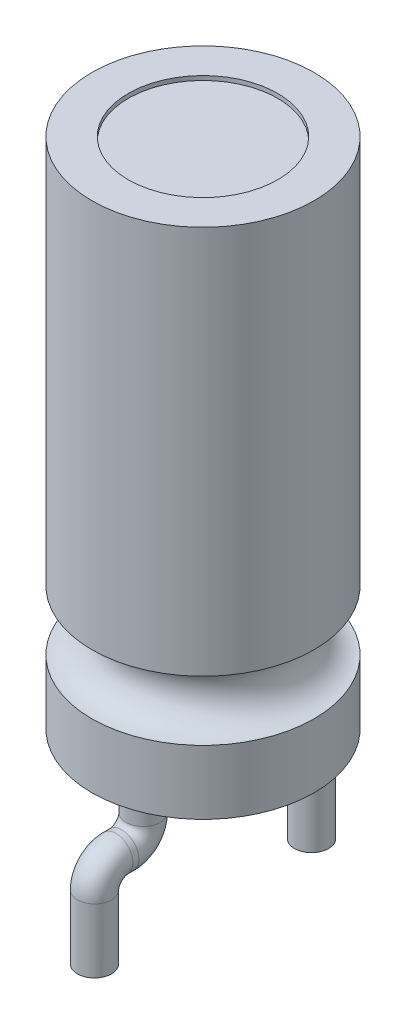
from build123d import *

# Parameters (mm, degrees)
ESQUISSE2_R             = 1.75
ENL_V_MAT_EXTRU_1_DEPTH = 0.1
ESQUISSE3_R             = 0.4
ESQUISSE6_R             = 0.4


with BuildPart() as part:
    # Esquisse1 → R_volution1 (revolve)
    with BuildSketch(Plane.XY, mode=Mode.PRIVATE) as r_volution1_sk:
        with BuildLine():
            Line((0, 39.516423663), (2.6, 39.516423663))
            Line((2.6, 39.516423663), (2.6, 30.416423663))
            ThreePointArc((2.6, 30.416423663), (1.9, 29.716423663), (2.6, 29.016423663))
            Line((2.6, 29.016423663), (2.6, 27.516423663))
            Line((2.6, 27.516423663), (0, 27.516423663))
            Line((0, 27.516423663), (0, 39.516423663))
        make_face()
    revolve(r_volution1_sk.sketch.rotate(Axis((0, 48.401709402, 0), (0, -1, 0)), 90), axis=Axis((0, 48.401709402, 0), (0, -1, 0)))

    # Esquisse2 → Enl_v. mat.-Extru.1 (cut)
    with BuildSketch(Plane(origin=(0, 39.516423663, 0), x_dir=(-1, 0, 0), z_dir=(0, 1, 0))):
        with Locations(Location((0, 0, 0), (0, 0, 90))):
            Circle(ESQUISSE2_R)
    extrude(amount=-ENL_V_MAT_EXTRU_1_DEPTH, mode=Mode.SUBTRACT)

    # Balayage2: sweep along a path in Esquisse4
    with BuildLine(Plane(origin=(0, 0, 0), x_dir=(0, 0, -1), z_dir=(1, 0, 0))) as balayage2_path:
        Line((-1.4, 27.516423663), (-1.4, 26.516423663))
        ThreePointArc((-1.4, 26.516423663), (-1.546446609, 26.162870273), (-1.9, 26.016423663))
        Line((-1.9, 26.016423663), (-2.04, 26.016423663))
        ThreePointArc((-2.04, 26.016423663), (-2.393553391, 25.869977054), (-2.54, 25.516423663))
        Line((-2.54, 25.516423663), (-2.54, 24.016423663))
    # Esquisse3 → Balayage2 (sweep)
    with BuildSketch(Plane.XZ.offset(-27.516423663)):
        with Locations((0, 1.4)):
            Circle(ESQUISSE3_R)
    sweep(path=balayage2_path.line)

    # Balayage3: sweep along a path in Esquisse7
    with BuildLine(Plane(origin=(0, 0, 0), x_dir=(0, 0, -1), z_dir=(1, 0, 0))) as balayage3_path:
        Line((1.4, 27.516423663), (1.4, 26.516423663))
        ThreePointArc((1.4, 26.516423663), (1.546446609, 26.162870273), (1.9, 26.016423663))
        Line((1.9, 26.016423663), (2.04, 26.016423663))
        ThreePointArc((2.04, 26.016423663), (2.393553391, 25.869977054), (2.54, 25.516423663))
        Line((2.54, 25.516423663), (2.54, 24.016423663))
    # Esquisse6 → Balayage3 (sweep)
    with BuildSketch(Plane.XZ.offset(-27.516423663)):
        with Locations((0, -1.4)):
            Circle(ESQUISSE6_R)
    sweep(path=balayage3_path.line)


solid = part.part
